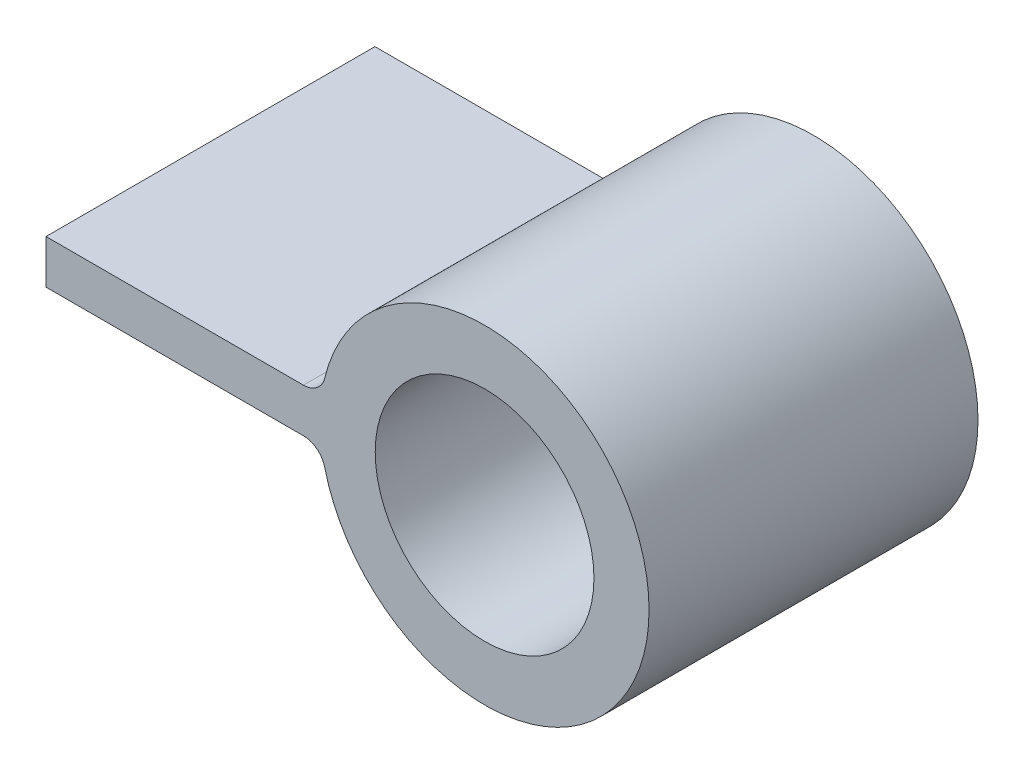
from build123d import *

# Parameters (mm, degrees)
SKETCH1_R          = 15
EXTRUDE1_DEPTH     = 30
SKETCH2_R          = 9.975
CUT_EXTRUDE1_DEPTH = 37.742346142
EXTRUDE2_DEPTH     = 30
FILLET1_R          = 2


with BuildPart() as part:
    # Sketch1 → Extrude1 (new body)
    with BuildSketch(Plane.XY):
        Circle(SKETCH1_R)
    extrude(amount=EXTRUDE1_DEPTH)

    # Sketch2 → Cut-Extrude1 (cut, through all)
    with BuildSketch(Plane.XY.offset(30)):
        Circle(SKETCH2_R)
    extrude(amount=-CUT_EXTRUDE1_DEPTH, mode=Mode.SUBTRACT)

    # Sketch3 → Extrude2 (add)
    with BuildSketch(Plane.XY):
        with BuildLine():
            Line((-40, -2), (-14.866068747, -2))
            ThreePointArc((-14.866068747, -2), (-15, 0), (-14.866068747, 2))
            Line((-14.866068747, 2), (-40, 2))
            Line((-40, 2), (-40, -2))
        make_face()
    extrude(amount=EXTRUDE2_DEPTH)

    # Fillet1
    fillet1_edges = [part.edges().sort_by_distance(p)[0] for p in [
        (-14.866068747, -2, 15),
        (-14.866068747, 2, 15),
    ]]
    fillet(fillet1_edges, radius=FILLET1_R)


solid = part.part
